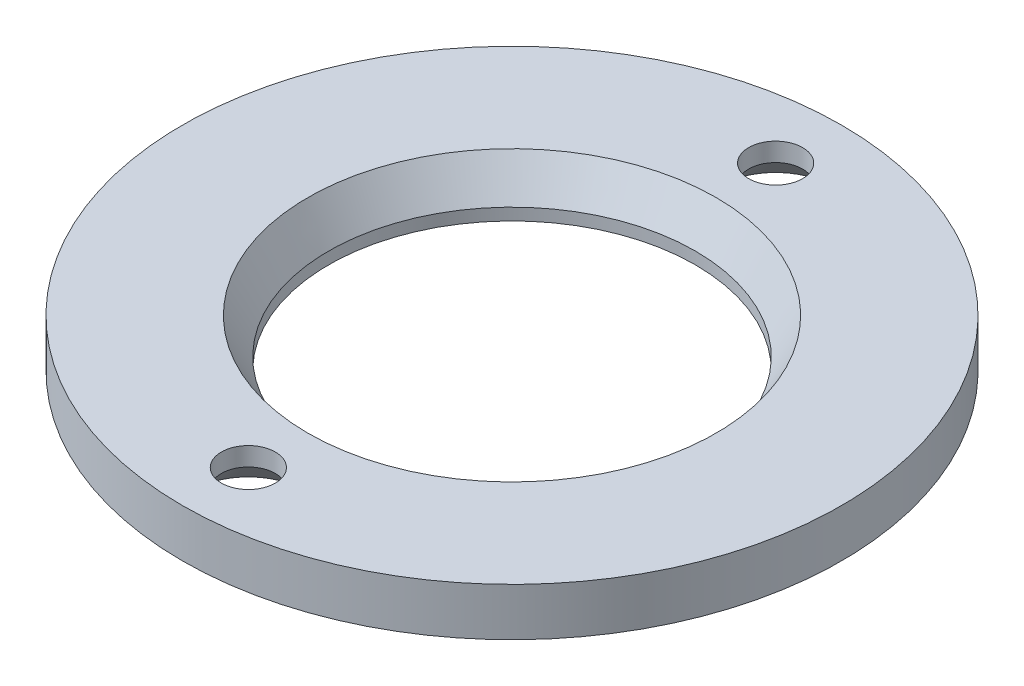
ISO-10303-21;
HEADER;
FILE_DESCRIPTION(('STEP AP214'),'2;1');
FILE_NAME('part.step','',(''),(''),'','','');
FILE_SCHEMA(('AUTOMOTIVE_DESIGN { 1 0 10303 214 1 1 1 1 }'));
ENDSEC;
DATA;
#1=APPLICATION_CONTEXT('core data for automotive mechanical design processes');
#2=APPLICATION_PROTOCOL_DEFINITION('international standard','automotive_design',2000,#1);
#3=PRODUCT_CONTEXT('',#1,'mechanical');
#4=PRODUCT('Part','Part','',(#3));
#5=PRODUCT_RELATED_PRODUCT_CATEGORY('part','',(#4));
#6=PRODUCT_DEFINITION_FORMATION('','',#4);
#7=PRODUCT_DEFINITION_CONTEXT('part definition',#1,'design');
#8=PRODUCT_DEFINITION('design','',#6,#7);
#9=PRODUCT_DEFINITION_SHAPE('','',#8);
#10=(LENGTH_UNIT() NAMED_UNIT(*) SI_UNIT(.MILLI.,.METRE.));
#11=(NAMED_UNIT(*) PLANE_ANGLE_UNIT() SI_UNIT($,.RADIAN.));
#12=(NAMED_UNIT(*) SI_UNIT($,.STERADIAN.) SOLID_ANGLE_UNIT());
#13=UNCERTAINTY_MEASURE_WITH_UNIT(LENGTH_MEASURE(1.E-05),#10,'distance_accuracy_value','');
#14=(GEOMETRIC_REPRESENTATION_CONTEXT(3) GLOBAL_UNCERTAINTY_ASSIGNED_CONTEXT((#13)) GLOBAL_UNIT_ASSIGNED_CONTEXT((#10,
#11,#12)) REPRESENTATION_CONTEXT('',''));
#15=CARTESIAN_POINT('',(0.,0.,0.));
#16=DIRECTION('',(0.,0.,1.));
#17=DIRECTION('',(1.,0.,0.));
#18=AXIS2_PLACEMENT_3D('',#15,#16,#17);
#19=CARTESIAN_POINT('',(0.,4.,0.));
#20=DIRECTION('',(0.,1.,0.));
#21=DIRECTION('',(0.,0.,1.));
#22=AXIS2_PLACEMENT_3D('',#19,#20,#21);
#23=PLANE('',#22);
#24=CARTESIAN_POINT('',(0.,4.00000000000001,22.));
#25=DIRECTION('',(0.,-1.,0.));
#26=DIRECTION('',(0.,0.,-1.));
#27=AXIS2_PLACEMENT_3D('',#24,#25,#26);
#28=CIRCLE('',#27,2.25);
#29=CARTESIAN_POINT('',(0.,4.00000000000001,19.75));
#30=VERTEX_POINT('',#29);
#31=EDGE_CURVE('E60',#30,#30,#28,.T.);
#32=ORIENTED_EDGE('',*,*,#31,.T.);
#33=EDGE_LOOP('',(#32));
#34=FACE_BOUND('',#33,.T.);
#35=CARTESIAN_POINT('',(0.,4.,0.));
#36=DIRECTION('',(0.,1.,0.));
#37=DIRECTION('',(0.,0.,1.));
#38=AXIS2_PLACEMENT_3D('',#35,#36,#37);
#39=CIRCLE('',#38,27.5);
#40=CARTESIAN_POINT('',(0.,4.,27.5));
#41=VERTEX_POINT('',#40);
#42=EDGE_CURVE('E10',#41,#41,#39,.T.);
#43=ORIENTED_EDGE('',*,*,#42,.T.);
#44=EDGE_LOOP('',(#43));
#45=FACE_BOUND('',#44,.T.);
#46=CARTESIAN_POINT('',(0.,4.00000000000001,0.));
#47=DIRECTION('',(0.,-1.,0.));
#48=DIRECTION('',(0.,0.,-1.));
#49=AXIS2_PLACEMENT_3D('',#46,#47,#48);
#50=CIRCLE('',#49,17.0320508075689);
#51=CARTESIAN_POINT('',(0.,4.00000000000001,-17.0320508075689));
#52=VERTEX_POINT('',#51);
#53=EDGE_CURVE('E41',#52,#52,#50,.T.);
#54=ORIENTED_EDGE('',*,*,#53,.T.);
#55=EDGE_LOOP('',(#54));
#56=FACE_BOUND('',#55,.T.);
#57=CARTESIAN_POINT('',(0.,4.00000000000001,-22.));
#58=DIRECTION('',(0.,-1.,0.));
#59=DIRECTION('',(0.,0.,-1.));
#60=AXIS2_PLACEMENT_3D('',#57,#58,#59);
#61=CIRCLE('',#60,2.25);
#62=CARTESIAN_POINT('',(0.,4.00000000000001,-24.25));
#63=VERTEX_POINT('',#62);
#64=EDGE_CURVE('E51',#63,#63,#61,.T.);
#65=ORIENTED_EDGE('',*,*,#64,.T.);
#66=EDGE_LOOP('',(#65));
#67=FACE_BOUND('',#66,.T.);
#68=ADVANCED_FACE('F30',(#34,#45,#56,#67),#23,.T.);
#69=CARTESIAN_POINT('',(0.,4.,0.));
#70=DIRECTION('',(0.,-1.,0.));
#71=DIRECTION('',(0.,0.,-1.));
#72=AXIS2_PLACEMENT_3D('',#69,#70,#71);
#73=CYLINDRICAL_SURFACE('',#72,27.5);
#74=ORIENTED_EDGE('',*,*,#42,.F.);
#75=EDGE_LOOP('',(#74));
#76=FACE_BOUND('',#75,.T.);
#77=CARTESIAN_POINT('',(0.,0.,0.));
#78=DIRECTION('',(0.,1.,0.));
#79=DIRECTION('',(0.,0.,1.));
#80=AXIS2_PLACEMENT_3D('',#77,#78,#79);
#81=CIRCLE('',#80,27.5);
#82=CARTESIAN_POINT('',(0.,0.,27.5));
#83=VERTEX_POINT('',#82);
#84=EDGE_CURVE('E34',#83,#83,#81,.T.);
#85=ORIENTED_EDGE('',*,*,#84,.T.);
#86=EDGE_LOOP('',(#85));
#87=FACE_BOUND('',#86,.T.);
#88=ADVANCED_FACE('F32',(#76,#87),#73,.T.);
#89=CARTESIAN_POINT('',(0.,0.,0.));
#90=DIRECTION('',(0.,1.,0.));
#91=DIRECTION('',(0.,0.,1.));
#92=AXIS2_PLACEMENT_3D('',#89,#90,#91);
#93=PLANE('',#92);
#94=CARTESIAN_POINT('',(0.,0.,22.));
#95=DIRECTION('',(0.,-1.,0.));
#96=DIRECTION('',(0.,0.,-1.));
#97=AXIS2_PLACEMENT_3D('',#94,#95,#96);
#98=CIRCLE('',#97,4.7);
#99=CARTESIAN_POINT('',(0.,0.,17.3));
#100=VERTEX_POINT('',#99);
#101=EDGE_CURVE('E66',#100,#100,#98,.T.);
#102=ORIENTED_EDGE('',*,*,#101,.F.);
#103=EDGE_LOOP('',(#102));
#104=FACE_BOUND('',#103,.T.);
#105=CARTESIAN_POINT('',(0.,0.,-22.));
#106=DIRECTION('',(0.,-1.,0.));
#107=DIRECTION('',(0.,0.,-1.));
#108=AXIS2_PLACEMENT_3D('',#105,#106,#107);
#109=CIRCLE('',#108,4.7);
#110=CARTESIAN_POINT('',(0.,0.,-26.7));
#111=VERTEX_POINT('',#110);
#112=EDGE_CURVE('E57',#111,#111,#109,.T.);
#113=ORIENTED_EDGE('',*,*,#112,.F.);
#114=EDGE_LOOP('',(#113));
#115=FACE_BOUND('',#114,.T.);
#116=CARTESIAN_POINT('',(0.,0.,0.));
#117=DIRECTION('',(0.,-1.,0.));
#118=DIRECTION('',(0.,0.,-1.));
#119=AXIS2_PLACEMENT_3D('',#116,#117,#118);
#120=CIRCLE('',#119,15.3);
#121=CARTESIAN_POINT('',(0.,0.,-15.3));
#122=VERTEX_POINT('',#121);
#123=EDGE_CURVE('E48',#122,#122,#120,.T.);
#124=ORIENTED_EDGE('',*,*,#123,.F.);
#125=EDGE_LOOP('',(#124));
#126=FACE_BOUND('',#125,.T.);
#127=ORIENTED_EDGE('',*,*,#84,.F.);
#128=EDGE_LOOP('',(#127));
#129=FACE_BOUND('',#128,.T.);
#130=ADVANCED_FACE('F72',(#104,#115,#126,#129),#93,.F.);
#131=CARTESIAN_POINT('',(0.,1.,0.));
#132=DIRECTION('',(0.,1.,0.));
#133=DIRECTION('',(0.,0.,1.));
#134=AXIS2_PLACEMENT_3D('',#131,#132,#133);
#135=CONICAL_SURFACE('',#134,15.3,0.523598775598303);
#136=ORIENTED_EDGE('',*,*,#53,.F.);
#137=EDGE_LOOP('',(#136));
#138=FACE_BOUND('',#137,.T.);
#139=CARTESIAN_POINT('',(0.,1.,0.));
#140=DIRECTION('',(0.,-1.,0.));
#141=DIRECTION('',(0.,0.,-1.));
#142=AXIS2_PLACEMENT_3D('',#139,#140,#141);
#143=CIRCLE('',#142,15.3);
#144=CARTESIAN_POINT('',(0.,1.,-15.3));
#145=VERTEX_POINT('',#144);
#146=EDGE_CURVE('E45',#145,#145,#143,.T.);
#147=ORIENTED_EDGE('',*,*,#146,.T.);
#148=EDGE_LOOP('',(#147));
#149=FACE_BOUND('',#148,.T.);
#150=ADVANCED_FACE('F75',(#138,#149),#135,.F.);
#151=CARTESIAN_POINT('',(0.,0.,0.));
#152=DIRECTION('',(0.,-1.,0.));
#153=DIRECTION('',(0.,0.,-1.));
#154=AXIS2_PLACEMENT_3D('',#151,#152,#153);
#155=CYLINDRICAL_SURFACE('',#154,15.3);
#156=ORIENTED_EDGE('',*,*,#146,.F.);
#157=EDGE_LOOP('',(#156));
#158=FACE_BOUND('',#157,.T.);
#159=ORIENTED_EDGE('',*,*,#123,.T.);
#160=EDGE_LOOP('',(#159));
#161=FACE_BOUND('',#160,.T.);
#162=ADVANCED_FACE('F94',(#158,#161),#155,.F.);
#163=CARTESIAN_POINT('',(0.,0.,-22.));
#164=DIRECTION('',(0.,-1.,0.));
#165=DIRECTION('',(0.,0.,-1.));
#166=AXIS2_PLACEMENT_3D('',#163,#164,#165);
#167=CYLINDRICAL_SURFACE('',#166,2.24999999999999);
#168=ORIENTED_EDGE('',*,*,#64,.F.);
#169=EDGE_LOOP('',(#168));
#170=FACE_BOUND('',#169,.T.);
#171=CARTESIAN_POINT('',(0.,2.45000000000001,-22.));
#172=DIRECTION('',(0.,-1.,0.));
#173=DIRECTION('',(0.,0.,-1.));
#174=AXIS2_PLACEMENT_3D('',#171,#172,#173);
#175=CIRCLE('',#174,2.24999999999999);
#176=CARTESIAN_POINT('',(0.,2.45000000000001,-24.25));
#177=VERTEX_POINT('',#176);
#178=EDGE_CURVE('E54',#177,#177,#175,.T.);
#179=ORIENTED_EDGE('',*,*,#178,.T.);
#180=EDGE_LOOP('',(#179));
#181=FACE_BOUND('',#180,.T.);
#182=ADVANCED_FACE('F98',(#170,#181),#167,.F.);
#183=CARTESIAN_POINT('',(0.,0.,-22.));
#184=DIRECTION('',(0.,-1.,0.));
#185=DIRECTION('',(0.,0.,-1.));
#186=AXIS2_PLACEMENT_3D('',#183,#184,#185);
#187=CONICAL_SURFACE('',#186,4.7,0.785398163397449);
#188=ORIENTED_EDGE('',*,*,#178,.F.);
#189=EDGE_LOOP('',(#188));
#190=FACE_BOUND('',#189,.T.);
#191=ORIENTED_EDGE('',*,*,#112,.T.);
#192=EDGE_LOOP('',(#191));
#193=FACE_BOUND('',#192,.T.);
#194=ADVANCED_FACE('F102',(#190,#193),#187,.F.);
#195=CARTESIAN_POINT('',(0.,0.,22.));
#196=DIRECTION('',(0.,-1.,0.));
#197=DIRECTION('',(0.,0.,-1.));
#198=AXIS2_PLACEMENT_3D('',#195,#196,#197);
#199=CYLINDRICAL_SURFACE('',#198,2.24999999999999);
#200=ORIENTED_EDGE('',*,*,#31,.F.);
#201=EDGE_LOOP('',(#200));
#202=FACE_BOUND('',#201,.T.);
#203=CARTESIAN_POINT('',(0.,2.45000000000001,22.));
#204=DIRECTION('',(0.,-1.,0.));
#205=DIRECTION('',(0.,0.,-1.));
#206=AXIS2_PLACEMENT_3D('',#203,#204,#205);
#207=CIRCLE('',#206,2.24999999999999);
#208=CARTESIAN_POINT('',(0.,2.45000000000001,19.75));
#209=VERTEX_POINT('',#208);
#210=EDGE_CURVE('E63',#209,#209,#207,.T.);
#211=ORIENTED_EDGE('',*,*,#210,.T.);
#212=EDGE_LOOP('',(#211));
#213=FACE_BOUND('',#212,.T.);
#214=ADVANCED_FACE('F106',(#202,#213),#199,.F.);
#215=CARTESIAN_POINT('',(0.,0.,22.));
#216=DIRECTION('',(0.,-1.,0.));
#217=DIRECTION('',(0.,0.,-1.));
#218=AXIS2_PLACEMENT_3D('',#215,#216,#217);
#219=CONICAL_SURFACE('',#218,4.7,0.785398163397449);
#220=ORIENTED_EDGE('',*,*,#210,.F.);
#221=EDGE_LOOP('',(#220));
#222=FACE_BOUND('',#221,.T.);
#223=ORIENTED_EDGE('',*,*,#101,.T.);
#224=EDGE_LOOP('',(#223));
#225=FACE_BOUND('',#224,.T.);
#226=ADVANCED_FACE('F70',(#222,#225),#219,.F.);
#227=CLOSED_SHELL('',(#68,#88,#130,#150,#162,#182,#194,#214,#226));
#228=MANIFOLD_SOLID_BREP('B2',#227);
#229=ADVANCED_BREP_SHAPE_REPRESENTATION('',(#18,#228),#14);
#230=SHAPE_DEFINITION_REPRESENTATION(#9,#229);
ENDSEC;
END-ISO-10303-21;
